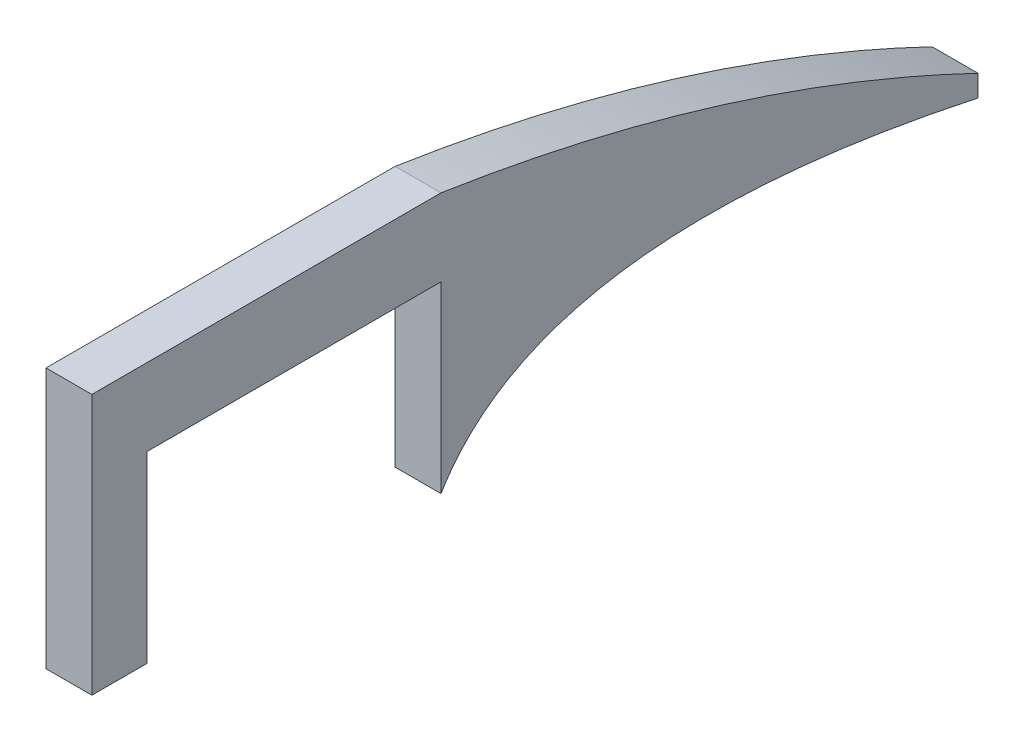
from build123d import *

# Parameters (mm, degrees)
BOSS_EXTRUDE1_DEPTH = 6.35


with BuildPart() as part:
    # Sketch1 → Boss-Extrude1 (new body)
    with BuildSketch(Plane(origin=(0, 0, 0), x_dir=(0, 0, -1), z_dir=(1, 0, 0))):
        with BuildLine():
            add(Edge.make_bspline(
                [(-13.004232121, 18.034), (26.339160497, 12.00381916), (61.341, -4.798144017)],
                knots=[0, 0, 0, 0.877774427, 0.877774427, 0.877774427], degree=2))
            Line((61.341, -4.798144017), (61.341, -7.767747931))
            add(Edge.make_bspline(
                [(61.341, -7.767747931), (0.863351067, 5.2754767), (-13.004232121, -18.034)],
                knots=[0, 0, 0, 0.897121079, 0.897121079, 0.897121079], degree=2))
            Line((-13.004232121, -18.034), (-13.004232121, 7.366))
            Line((-13.004232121, 7.366), (-53.721, 7.366))
            Line((-53.721, 7.366), (-53.721, -18.034))
            Line((-53.721, -18.034), (-61.341, -18.034))
            Line((-61.341, -18.034), (-61.341, 18.034))
            Line((-61.341, 18.034), (-13.004232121, 18.034))
        make_face()
    extrude(amount=BOSS_EXTRUDE1_DEPTH)


solid = part.part
